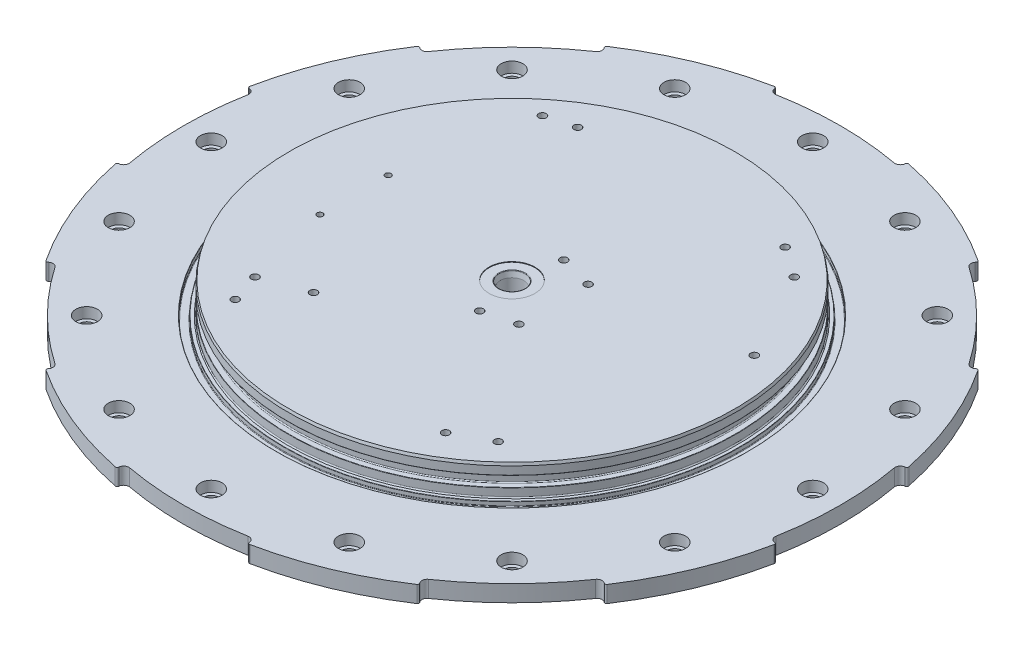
from build123d import *

# Parameters (mm, degrees)
F_6_32_TAPPED_HOLE1_D                           = 2.7051
F_6_32_TAPPED_HOLE1_DEPTH                       = 11.176
F_6_32_TAPPED_HOLE1_TIP                         = 0.81269403
CBORE_FOR_10_BUTTON_HEAD_CAP_SCREW1_D           = 6.6294
CBORE_FOR_10_BUTTON_HEAD_CAP_SCREW1_CBORE_D     = 9.92124
CBORE_FOR_10_BUTTON_HEAD_CAP_SCREW1_CBORE_DEPTH = 4.8514
CIRPATTERN1_COUNT                               = 16
CUT_EXTRUDE6_DEPTH                              = 219.666931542
FILLET1_R                                       = 0.79375
FILLET2_R                                       = 2.38125
CIRPATTERN2_COUNT                               = 8
FILLET1_OF_CIRPATTERN2_R                        = 0.79375
FILLET2_OF_CIRPATTERN2_R                        = 2.38125
F_8_32_TAPPED_HOLE1_D                           = 3.4544
F_8_32_TAPPED_HOLE1_DEPTH                       = 10.668
F_8_32_TAPPED_HOLE1_TIP                         = 1.037806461


with BuildPart() as part:
    # Sketch1 → Revolve1 (revolve)
    with BuildSketch(Plane.XY, mode=Mode.PRIVATE) as revolve1_sk:
        with BuildLine():
            Line((0, 0), (-102.250304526, 0))
            Line((-102.250304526, 0), (-102.5906, -1.27))
            Line((-102.5906, -1.27), (-102.5906, -4.953))
            ThreePointArc((-102.5906, -4.953), (-102.553402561, -5.042802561), (-102.4636, -5.08))
            Line((-102.4636, -5.08), (-100.2157, -5.08))
            ThreePointArc((-100.2157, -5.08), (-99.901391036, -5.210191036), (-99.7712, -5.5245))
            Line((-99.7712, -5.5245), (-99.7712, -9.4488))
            ThreePointArc((-99.7712, -9.4488), (-99.901391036, -9.763108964), (-100.2157, -9.8933))
            Line((-100.2157, -9.8933), (-102.4636, -9.8933))
            ThreePointArc((-102.4636, -9.8933), (-102.553402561, -9.930497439), (-102.5906, -10.0203))
            Line((-102.5906, -10.0203), (-102.5906, -13.462))
            ThreePointArc((-102.5906, -13.462), (-102.739389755, -13.821210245), (-103.0986, -13.97))
            Line((-103.0986, -13.97), (-154.305, -13.97))
            Line((-154.305, -13.97), (-154.305, -21.59))
            Line((-154.305, -21.59), (-120, -21.59))
            Line((-120, -21.59), (0, -15.301066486))
            Line((0, -15.301066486), (0, 0))
        make_face()
    revolve(revolve1_sk.sketch.rotate(Axis((0, 0, 0), (0, 1, 0)), 270), axis=Axis((0, 0, 0), (0, 1, 0)))

    # Sketch39 → 2-172 O-Ring (revolve, cut)
    with BuildSketch(Plane.XY, mode=Mode.PRIVATE) as f_2_172_o_ring_sk:
        with BuildLine():
            Line((-108.2675, -13.97), (-104.4829, -13.97))
            ThreePointArc((-104.4829, -13.97), (-104.572702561, -14.007197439), (-104.6099, -14.097))
            Line((-104.6099, -14.097), (-104.6099, -15.6718))
            ThreePointArc((-104.6099, -15.6718), (-104.684294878, -15.851405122), (-104.8639, -15.9258))
            Line((-104.8639, -15.9258), (-107.8865, -15.9258))
            ThreePointArc((-107.8865, -15.9258), (-108.066105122, -15.851405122), (-108.1405, -15.6718))
            Line((-108.1405, -15.6718), (-108.1405, -14.097))
            ThreePointArc((-108.1405, -14.097), (-108.177697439, -14.007197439), (-108.2675, -13.97))
        make_face()
    revolve(f_2_172_o_ring_sk.sketch.rotate(Axis((0, -456.133279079, 0), (0, 1, 0)), 270), axis=Axis((0, -456.133279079, 0), (0, 1, 0)), mode=Mode.SUBTRACT)

    # 6-32 Tapped Hole1
    with Locations(Plane(origin=(0, 0, 0), x_dir=(1, 0, 0), z_dir=(0, 1, 0))):
        with Locations((-70.1675, 13.3105), (-70.1675, -17.9645)):
            Hole(F_6_32_TAPPED_HOLE1_D / 2, depth=F_6_32_TAPPED_HOLE1_DEPTH)
            with Locations((0, 0, -(F_6_32_TAPPED_HOLE1_DEPTH + F_6_32_TAPPED_HOLE1_TIP / 2))):  # 118° drill point
                Cone(0, F_6_32_TAPPED_HOLE1_D / 2, F_6_32_TAPPED_HOLE1_TIP, mode=Mode.SUBTRACT)

    # CBORE for _10 Button Head Cap Screw1 (through all)
    with Locations(Plane(origin=(0, -13.97, 0), x_dir=(1, 0, 0), z_dir=(0, 1, 0))):
        with Locations((0, 138)):
            cbore_for_10_button_head_cap_screw1 = CounterBoreHole(CBORE_FOR_10_BUTTON_HEAD_CAP_SCREW1_D / 2, CBORE_FOR_10_BUTTON_HEAD_CAP_SCREW1_CBORE_D / 2, CBORE_FOR_10_BUTTON_HEAD_CAP_SCREW1_CBORE_DEPTH)

    # CirPattern1: CBORE for _10 Button Head Cap Screw1 ×16 about axis
    cirpattern1_axis = Axis((0, 0, 0), (0, 1, 0))
    for i in range(1, CIRPATTERN1_COUNT):
        add(cbore_for_10_button_head_cap_screw1.rotate(cirpattern1_axis, i * 360 / CIRPATTERN1_COUNT), mode=Mode.SUBTRACT)

    # Sketch49 → Cut-Extrude6 (cut, through all)
    with BuildSketch(Plane(origin=(0, -13.97, 0), x_dir=(1, 0, 0), z_dir=(0, 1, 0))):
        with BuildLine():
            Line((-151.340072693, -30.103412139), (-147.852400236, -29.409670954))
            ThreePointArc((-147.852400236, -29.409670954), (-150.749, 0), (-147.852400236, 29.409670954))
            Line((-147.852400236, 29.409670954), (-151.340072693, 30.103412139))
            ThreePointArc((-151.340072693, 30.103412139), (-154.305, 0), (-151.340072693, -30.103412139))
        make_face()
    cut_extrude6 = extrude(amount=-CUT_EXTRUDE6_DEPTH, mode=Mode.SUBTRACT)

    # Fillet1
    fillet1_edges = [part.edges().sort_by_distance(p)[0] for p in [
        (-151.340072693, -17.78, 30.103412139),
        (-151.340072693, -17.78, -30.103412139),
    ]]
    fillet(fillet1_edges, radius=FILLET1_R)

    # Fillet2
    fillet2_edges = [part.edges().sort_by_distance(p)[0] for p in [
        (-147.852400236, -17.78, -29.409670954),
        (-147.852400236, -17.78, 29.409670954),
    ]]
    fillet(fillet2_edges, radius=FILLET2_R)

    # CirPattern2: Cut-Extrude6 ×8 about axis
    cirpattern2_axis = Axis((0, 0, 0), (0, 1, 0))
    for i in range(1, CIRPATTERN2_COUNT):
        add(cut_extrude6.rotate(cirpattern2_axis, i * 360 / CIRPATTERN2_COUNT), mode=Mode.SUBTRACT)

    # Fillet1 of CirPattern2
    fillet1_of_cirpattern2_edges = [part.edges().sort_by_distance(p)[0] for p in [
        (-85.727264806, -17.78, 128.299918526),
        (-128.299918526, -17.78, 85.727264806),
        (30.103412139, -17.78, 151.340072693),
        (-30.103412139, -17.78, 151.340072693),
        (128.299918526, -17.78, 85.727264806),
        (85.727264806, -17.78, 128.299918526),
        (151.340072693, -17.78, -30.103412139),
        (151.340072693, -17.78, 30.103412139),
        (85.727264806, -17.78, -128.299918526),
        (128.299918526, -17.78, -85.727264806),
        (-30.103412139, -17.78, -151.340072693),
        (30.103412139, -17.78, -151.340072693),
        (-128.299918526, -17.78, -85.727264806),
        (-85.727264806, -17.78, -128.299918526),
    ]]
    fillet(fillet1_of_cirpattern2_edges, radius=FILLET1_OF_CIRPATTERN2_R)

    # Fillet2 of CirPattern2
    fillet2_of_cirpattern2_edges = [part.edges().sort_by_distance(p)[0] for p in [
        (-125.343212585, -17.78, 83.751657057),
        (-83.751657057, -17.78, 125.343212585),
        (-29.409670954, -17.78, 147.852400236),
        (29.409670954, -17.78, 147.852400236),
        (83.751657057, -17.78, 125.343212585),
        (125.343212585, -17.78, 83.751657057),
        (147.852400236, -17.78, 29.409670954),
        (147.852400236, -17.78, -29.409670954),
        (125.343212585, -17.78, -83.751657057),
        (83.751657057, -17.78, -125.343212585),
        (29.409670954, -17.78, -147.852400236),
        (-29.409670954, -17.78, -147.852400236),
        (-83.751657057, -17.78, -125.343212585),
        (-125.343212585, -17.78, -83.751657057),
    ]]
    fillet(fillet2_of_cirpattern2_edges, radius=FILLET2_OF_CIRPATTERN2_R)

    # Port Sketch → SAE Port (revolve, cut)
    with BuildSketch(Plane(origin=(0.23044085, 0, -1.827159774), x_dir=(0.1251284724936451, 0, -0.9921405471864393), z_dir=(-0.9921405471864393, 0, -0.1251284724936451)), mode=Mode.PRIVATE) as sae_port_sk:
        with BuildLine():
            Line((-1.841634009, 28.634641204), (3.118985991, 25.654))
            Line((3.118985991, 25.654), (3.118985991, 11.754))
            Line((3.118985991, 11.754), (3.714615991, 11.754))
            Line((3.714615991, 11.754), (3.714615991, 2.764417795))
            Line((3.714615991, 2.764417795), (3.625033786, 2.854))
            Line((3.625033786, 2.854), (4.1349165, 0.455190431))
            ThreePointArc((4.1349165, 0.455190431), (4.223518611, 0.310604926), (4.383365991, 0.254))
            Line((4.383365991, 0.254), (8.658365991, 0.254))
            Line((8.658365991, 0.254), (8.658365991, 0))
            Line((8.658365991, 0), (-1.841634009, 0))
            Line((-1.841634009, 0), (-1.841634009, 28.634641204))
        make_face()
    revolve(sae_port_sk.sketch.rotate(Axis((0, 0, 0), (0, -1, 0)), 172.811825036), axis=Axis((0, 0, 0), (0, -1, 0)), mode=Mode.SUBTRACT)

    # 8-32 Tapped Hole1
    with Locations(Plane(origin=(0, 0, 0), x_dir=(1, 0, 0), z_dir=(0, 1, 0))):
        with Locations((-55.88, -71.12), (60.96, -67.31), (63.5, 66.04), (-58.42, 72.39), (19.05, -15.875), (19.05, 15.875), (3.803467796, 19.942392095), (4.78310182, -19.627430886), (85.394949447, 25.766119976), (49.53, 75.816424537), (-45.72, 75.816424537), (-60.291233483, -57.646524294), (45.339, -75.816424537), (-40.64, -50.416424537)):
            Hole(F_8_32_TAPPED_HOLE1_D / 2, depth=F_8_32_TAPPED_HOLE1_DEPTH)
            with Locations((0, 0, -(F_8_32_TAPPED_HOLE1_DEPTH + F_8_32_TAPPED_HOLE1_TIP / 2))):  # 118° drill point
                Cone(0, F_8_32_TAPPED_HOLE1_D / 2, F_8_32_TAPPED_HOLE1_TIP, mode=Mode.SUBTRACT)

    # Sketch52 → ORing 2-274 (revolve, cut)
    with BuildSketch(Plane.XY, mode=Mode.PRIVATE) as oring_2_274_sk:
        with BuildLine():
            Line((-130.4544, -21.59), (-125.5776, -21.59))
            ThreePointArc((-125.5776, -21.59), (-125.667402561, -21.552802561), (-125.7046, -21.463))
            Line((-125.7046, -21.463), (-125.7046, -19.3929))
            ThreePointArc((-125.7046, -19.3929), (-125.834791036, -19.078591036), (-126.1491, -18.9484))
            Line((-126.1491, -18.9484), (-129.8829, -18.9484))
            ThreePointArc((-129.8829, -18.9484), (-130.197208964, -19.078591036), (-130.3274, -19.3929))
            Line((-130.3274, -19.3929), (-130.3274, -21.463))
            ThreePointArc((-130.3274, -21.463), (-130.364597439, -21.552802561), (-130.4544, -21.59))
        make_face()
    revolve(oring_2_274_sk.sketch.rotate(Axis((0, 0, 0), (0, -1, 0)), 270), axis=Axis((0, 0, 0), (0, -1, 0)), mode=Mode.SUBTRACT)


solid = part.part
